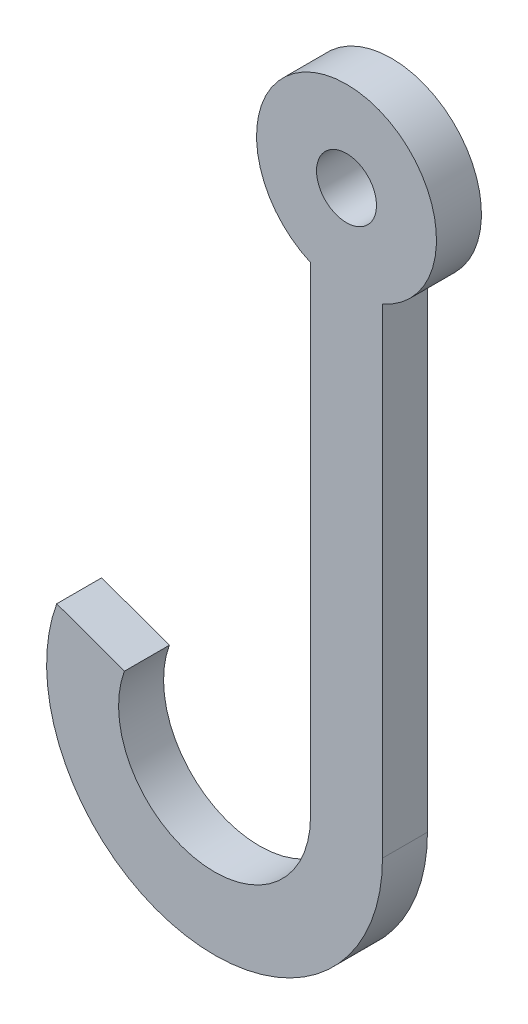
from build123d import *

# Parameters (mm, degrees)
SKETCH1_R           = 3.175
BOSS_EXTRUDE1_DEPTH = 4.7625


with BuildPart() as part:
    # Sketch1 → Boss-Extrude1 (new body)
    with BuildSketch(Plane.XY):
        with BuildLine():
            Line((-3.81, -8.729806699), (-3.81, -59.529806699))
            ThreePointArc((-3.81, -59.529806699), (-15.734265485, -69.535453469), (-23.517277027, -56.054882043))
            Line((-23.517277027, -56.054882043), (-30.677734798, -53.448688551))
            ThreePointArc((-30.677734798, -53.448688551), (-17.057464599, -77.039688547), (3.81, -59.529806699))
            Line((3.81, -59.529806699), (3.81, -8.729806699))
            ThreePointArc((3.81, -8.729806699), (0, 9.525), (-3.81, -8.729806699))
        make_face()
        with Locations(Location((0, 0, 0), (0, 0, 180))):
            Circle(SKETCH1_R, mode=Mode.SUBTRACT)
    extrude(amount=BOSS_EXTRUDE1_DEPTH)


solid = part.part
